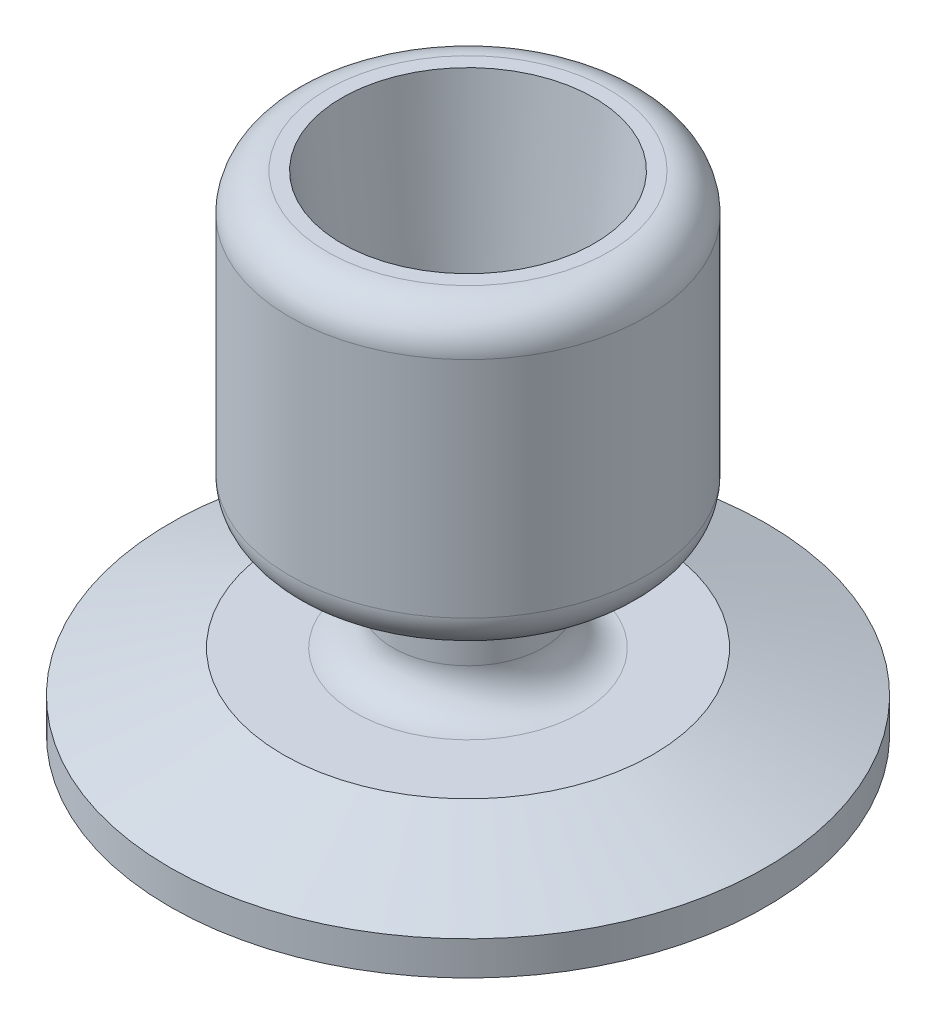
ISO-10303-21;
HEADER;
FILE_DESCRIPTION(('STEP AP214'),'2;1');
FILE_NAME('part.step','',(''),(''),'','','');
FILE_SCHEMA(('AUTOMOTIVE_DESIGN { 1 0 10303 214 1 1 1 1 }'));
ENDSEC;
DATA;
#1=APPLICATION_CONTEXT('core data for automotive mechanical design processes');
#2=APPLICATION_PROTOCOL_DEFINITION('international standard','automotive_design',2000,#1);
#3=PRODUCT_CONTEXT('',#1,'mechanical');
#4=PRODUCT('Part','Part','',(#3));
#5=PRODUCT_RELATED_PRODUCT_CATEGORY('part','',(#4));
#6=PRODUCT_DEFINITION_FORMATION('','',#4);
#7=PRODUCT_DEFINITION_CONTEXT('part definition',#1,'design');
#8=PRODUCT_DEFINITION('design','',#6,#7);
#9=PRODUCT_DEFINITION_SHAPE('','',#8);
#10=(LENGTH_UNIT() NAMED_UNIT(*) SI_UNIT(.MILLI.,.METRE.));
#11=(NAMED_UNIT(*) PLANE_ANGLE_UNIT() SI_UNIT($,.RADIAN.));
#12=(NAMED_UNIT(*) SI_UNIT($,.STERADIAN.) SOLID_ANGLE_UNIT());
#13=UNCERTAINTY_MEASURE_WITH_UNIT(LENGTH_MEASURE(1.E-05),#10,'distance_accuracy_value','');
#14=(GEOMETRIC_REPRESENTATION_CONTEXT(3) GLOBAL_UNCERTAINTY_ASSIGNED_CONTEXT((#13)) GLOBAL_UNIT_ASSIGNED_CONTEXT((#10,
#11,#12)) REPRESENTATION_CONTEXT('',''));
#15=CARTESIAN_POINT('',(0.,0.,0.));
#16=DIRECTION('',(0.,0.,1.));
#17=DIRECTION('',(1.,0.,0.));
#18=AXIS2_PLACEMENT_3D('',#15,#16,#17);
#19=CARTESIAN_POINT('',(16.6090232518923,33.7384781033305,40.9368676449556));
#20=DIRECTION('',(0.,-1.,0.));
#21=DIRECTION('',(0.,0.,-1.));
#22=AXIS2_PLACEMENT_3D('',#19,#20,#21);
#23=PLANE('',#22);
#24=CARTESIAN_POINT('',(21.3080232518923,33.7384781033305,40.9368676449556));
#25=DIRECTION('',(0.,-1.,0.));
#26=DIRECTION('',(0.,0.,-1.));
#27=AXIS2_PLACEMENT_3D('',#24,#25,#26);
#28=CIRCLE('',#27,6.35);
#29=CARTESIAN_POINT('',(21.3080232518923,33.7384781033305,34.5868676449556));
#30=VERTEX_POINT('',#29);
#31=EDGE_CURVE('P0_E10',#30,#30,#28,.T.);
#32=ORIENTED_EDGE('',*,*,#31,.F.);
#33=EDGE_LOOP('',(#32));
#34=FACE_BOUND('',#33,.T.);
#35=CARTESIAN_POINT('',(21.3080232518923,33.7384781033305,40.9368676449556));
#36=DIRECTION('',(0.,-1.,0.));
#37=DIRECTION('',(0.,0.,-1.));
#38=AXIS2_PLACEMENT_3D('',#35,#36,#37);
#39=CIRCLE('',#38,4.699);
#40=CARTESIAN_POINT('',(21.3080232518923,33.7384781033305,36.2378676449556));
#41=VERTEX_POINT('',#40);
#42=EDGE_CURVE('P0_E64',#41,#41,#39,.T.);
#43=ORIENTED_EDGE('',*,*,#42,.T.);
#44=EDGE_LOOP('',(#43));
#45=FACE_BOUND('',#44,.T.);
#46=ADVANCED_FACE('P0_F15',(#34,#45),#23,.F.);
#47=CARTESIAN_POINT('',(21.3080232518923,21.0384781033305,40.9368676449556));
#48=DIRECTION('',(0.,-1.,0.));
#49=DIRECTION('',(0.,0.,-1.));
#50=AXIS2_PLACEMENT_3D('',#47,#48,#49);
#51=CYLINDRICAL_SURFACE('',#50,6.35);
#52=CARTESIAN_POINT('',(21.3080232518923,30.5634781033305,40.9368676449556));
#53=DIRECTION('',(0.,-1.,0.));
#54=DIRECTION('',(0.,0.,-1.));
#55=AXIS2_PLACEMENT_3D('',#52,#53,#54);
#56=CIRCLE('',#55,6.35);
#57=CARTESIAN_POINT('',(21.3080232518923,30.5634781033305,34.5868676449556));
#58=VERTEX_POINT('',#57);
#59=EDGE_CURVE('P0_E21',#58,#58,#56,.T.);
#60=ORIENTED_EDGE('',*,*,#59,.F.);
#61=EDGE_LOOP('',(#60));
#62=FACE_BOUND('',#61,.T.);
#63=ORIENTED_EDGE('',*,*,#31,.T.);
#64=EDGE_LOOP('',(#63));
#65=FACE_BOUND('',#64,.T.);
#66=ADVANCED_FACE('P0_F143',(#62,#65),#51,.T.);
#67=CARTESIAN_POINT('',(21.3080232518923,30.5634781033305,40.9368676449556));
#68=DIRECTION('',(0.,-1.,0.));
#69=DIRECTION('',(0.,0.,-1.));
#70=AXIS2_PLACEMENT_3D('',#67,#68,#69);
#71=TOROIDAL_SURFACE('',#70,9.525,3.175);
#72=CARTESIAN_POINT('',(21.3080232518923,27.3884781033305,40.9368676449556));
#73=DIRECTION('',(0.,-1.,0.));
#74=DIRECTION('',(0.,0.,-1.));
#75=AXIS2_PLACEMENT_3D('',#72,#73,#74);
#76=CIRCLE('',#75,9.525);
#77=CARTESIAN_POINT('',(21.3080232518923,27.3884781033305,31.4118676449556));
#78=VERTEX_POINT('',#77);
#79=EDGE_CURVE('P0_E25',#78,#78,#76,.T.);
#80=ORIENTED_EDGE('',*,*,#79,.F.);
#81=EDGE_LOOP('',(#80));
#82=FACE_BOUND('',#81,.T.);
#83=ORIENTED_EDGE('',*,*,#59,.T.);
#84=EDGE_LOOP('',(#83));
#85=FACE_BOUND('',#84,.T.);
#86=ADVANCED_FACE('P0_F138',(#82,#85),#71,.F.);
#87=CARTESIAN_POINT('',(11.7830232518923,27.3884781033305,40.9368676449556));
#88=DIRECTION('',(0.,-1.,0.));
#89=DIRECTION('',(0.,0.,-1.));
#90=AXIS2_PLACEMENT_3D('',#87,#88,#89);
#91=PLANE('',#90);
#92=CARTESIAN_POINT('',(21.3080232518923,27.3884781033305,40.9368676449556));
#93=DIRECTION('',(0.,-1.,0.));
#94=DIRECTION('',(0.,0.,-1.));
#95=AXIS2_PLACEMENT_3D('',#92,#93,#94);
#96=CIRCLE('',#95,15.6301961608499);
#97=CARTESIAN_POINT('',(21.3080232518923,27.3884781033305,25.3066714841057));
#98=VERTEX_POINT('',#97);
#99=EDGE_CURVE('P0_E29',#98,#98,#96,.T.);
#100=ORIENTED_EDGE('',*,*,#99,.F.);
#101=EDGE_LOOP('',(#100));
#102=FACE_BOUND('',#101,.T.);
#103=ORIENTED_EDGE('',*,*,#79,.T.);
#104=EDGE_LOOP('',(#103));
#105=FACE_BOUND('',#104,.T.);
#106=ADVANCED_FACE('P0_F132',(#102,#105),#91,.F.);
#107=CARTESIAN_POINT('',(21.3080232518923,27.3884781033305,40.9368676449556));
#108=DIRECTION('',(0.,-1.,0.));
#109=DIRECTION('',(0.,0.,-1.));
#110=AXIS2_PLACEMENT_3D('',#107,#108,#109);
#111=CONICAL_SURFACE('',#110,15.6301961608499,1.22173047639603);
#112=CARTESIAN_POINT('',(21.3080232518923,23.9065190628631,40.9368676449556));
#113=DIRECTION('',(0.,-1.,0.));
#114=DIRECTION('',(0.,0.,-1.));
#115=AXIS2_PLACEMENT_3D('',#112,#113,#114);
#116=CIRCLE('',#115,25.1968);
#117=CARTESIAN_POINT('',(21.3080232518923,23.9065190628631,15.7400676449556));
#118=VERTEX_POINT('',#117);
#119=EDGE_CURVE('P0_E34',#118,#118,#116,.T.);
#120=ORIENTED_EDGE('',*,*,#119,.F.);
#121=EDGE_LOOP('',(#120));
#122=FACE_BOUND('',#121,.T.);
#123=ORIENTED_EDGE('',*,*,#99,.T.);
#124=EDGE_LOOP('',(#123));
#125=FACE_BOUND('',#124,.T.);
#126=ADVANCED_FACE('P0_F126',(#122,#125),#111,.T.);
#127=CARTESIAN_POINT('',(21.3080232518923,21.0384781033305,40.9368676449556));
#128=DIRECTION('',(0.,-1.,0.));
#129=DIRECTION('',(0.,0.,-1.));
#130=AXIS2_PLACEMENT_3D('',#127,#128,#129);
#131=CYLINDRICAL_SURFACE('',#130,25.1968);
#132=CARTESIAN_POINT('',(21.3080232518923,21.0384781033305,40.9368676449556));
#133=DIRECTION('',(0.,-1.,0.));
#134=DIRECTION('',(0.,0.,-1.));
#135=AXIS2_PLACEMENT_3D('',#132,#133,#134);
#136=CIRCLE('',#135,25.1968);
#137=CARTESIAN_POINT('',(21.3080232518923,21.0384781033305,15.7400676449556));
#138=VERTEX_POINT('',#137);
#139=EDGE_CURVE('P0_E37',#138,#138,#136,.T.);
#140=ORIENTED_EDGE('',*,*,#139,.F.);
#141=EDGE_LOOP('',(#140));
#142=FACE_BOUND('',#141,.T.);
#143=ORIENTED_EDGE('',*,*,#119,.T.);
#144=EDGE_LOOP('',(#143));
#145=FACE_BOUND('',#144,.T.);
#146=ADVANCED_FACE('P0_F120',(#142,#145),#131,.T.);
#147=CARTESIAN_POINT('',(-3.88877674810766,21.0384781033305,40.9368676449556));
#148=DIRECTION('',(0.,1.,0.));
#149=DIRECTION('',(0.,0.,1.));
#150=AXIS2_PLACEMENT_3D('',#147,#148,#149);
#151=PLANE('',#150);
#152=CARTESIAN_POINT('',(21.3080232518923,21.0384781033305,40.9368676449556));
#153=DIRECTION('',(0.,-1.,0.));
#154=DIRECTION('',(0.,0.,-1.));
#155=AXIS2_PLACEMENT_3D('',#152,#153,#154);
#156=CIRCLE('',#155,23.8091722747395);
#157=CARTESIAN_POINT('',(21.3080232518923,21.0384781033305,17.127695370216));
#158=VERTEX_POINT('',#157);
#159=EDGE_CURVE('P0_E40',#158,#158,#156,.T.);
#160=ORIENTED_EDGE('',*,*,#159,.F.);
#161=EDGE_LOOP('',(#160));
#162=FACE_BOUND('',#161,.T.);
#163=ORIENTED_EDGE('',*,*,#139,.T.);
#164=EDGE_LOOP('',(#163));
#165=FACE_BOUND('',#164,.T.);
#166=ADVANCED_FACE('P0_F114',(#162,#165),#151,.F.);
#167=CARTESIAN_POINT('',(21.3080232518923,21.8258781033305,40.9368676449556));
#168=DIRECTION('',(0.,-1.,0.));
#169=DIRECTION('',(0.,0.,-1.));
#170=AXIS2_PLACEMENT_3D('',#167,#168,#169);
#171=TOROIDAL_SURFACE('',#170,23.8091722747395,0.787399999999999);
#172=CARTESIAN_POINT('',(21.3080232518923,21.5182164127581,40.9368676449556));
#173=DIRECTION('',(0.,-1.,0.));
#174=DIRECTION('',(0.,0.,-1.));
#175=AXIS2_PLACEMENT_3D('',#172,#173,#174);
#176=CIRCLE('',#175,23.0843667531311);
#177=CARTESIAN_POINT('',(21.3080232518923,21.5182164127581,17.8525008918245));
#178=VERTEX_POINT('',#177);
#179=EDGE_CURVE('P0_E43',#178,#178,#176,.T.);
#180=ORIENTED_EDGE('',*,*,#179,.F.);
#181=EDGE_LOOP('',(#180));
#182=FACE_BOUND('',#181,.T.);
#183=ORIENTED_EDGE('',*,*,#159,.T.);
#184=EDGE_LOOP('',(#183));
#185=FACE_BOUND('',#184,.T.);
#186=ADVANCED_FACE('P0_F108',(#182,#185),#171,.T.);
#187=CARTESIAN_POINT('',(21.3080232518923,21.5182164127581,40.9368676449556));
#188=DIRECTION('',(0.,-1.,0.));
#189=DIRECTION('',(0.,0.,-1.));
#190=AXIS2_PLACEMENT_3D('',#187,#188,#189);
#191=CONICAL_SURFACE('',#190,23.0843667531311,0.401425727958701);
#192=CARTESIAN_POINT('',(21.3080232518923,21.911332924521,40.9368676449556));
#193=DIRECTION('',(0.,-1.,0.));
#194=DIRECTION('',(0.,0.,-1.));
#195=AXIS2_PLACEMENT_3D('',#192,#193,#194);
#196=CIRCLE('',#195,22.9174986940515);
#197=CARTESIAN_POINT('',(21.3080232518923,21.911332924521,18.019368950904));
#198=VERTEX_POINT('',#197);
#199=EDGE_CURVE('P0_E46',#198,#198,#196,.T.);
#200=ORIENTED_EDGE('',*,*,#199,.F.);
#201=EDGE_LOOP('',(#200));
#202=FACE_BOUND('',#201,.T.);
#203=ORIENTED_EDGE('',*,*,#179,.T.);
#204=EDGE_LOOP('',(#203));
#205=FACE_BOUND('',#204,.T.);
#206=ADVANCED_FACE('P0_F102',(#202,#205),#191,.F.);
#207=CARTESIAN_POINT('',(21.3080232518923,21.4448781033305,40.9368676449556));
#208=DIRECTION('',(0.,-1.,0.));
#209=DIRECTION('',(0.,0.,-1.));
#210=AXIS2_PLACEMENT_3D('',#207,#208,#209);
#211=TOROIDAL_SURFACE('',#210,21.8186,1.1938);
#212=CARTESIAN_POINT('',(21.3080232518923,21.911332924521,40.9368676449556));
#213=DIRECTION('',(0.,-1.,0.));
#214=DIRECTION('',(0.,0.,-1.));
#215=AXIS2_PLACEMENT_3D('',#212,#213,#214);
#216=CIRCLE('',#215,20.7197013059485);
#217=CARTESIAN_POINT('',(21.3080232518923,21.911332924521,20.2171663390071));
#218=VERTEX_POINT('',#217);
#219=EDGE_CURVE('P0_E49',#218,#218,#216,.T.);
#220=ORIENTED_EDGE('',*,*,#219,.F.);
#221=EDGE_LOOP('',(#220));
#222=FACE_BOUND('',#221,.T.);
#223=ORIENTED_EDGE('',*,*,#199,.T.);
#224=EDGE_LOOP('',(#223));
#225=FACE_BOUND('',#224,.T.);
#226=ADVANCED_FACE('P0_F96',(#222,#225),#211,.F.);
#227=CARTESIAN_POINT('',(21.3080232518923,21.911332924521,40.9368676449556));
#228=DIRECTION('',(0.,1.,0.));
#229=DIRECTION('',(0.,0.,1.));
#230=AXIS2_PLACEMENT_3D('',#227,#228,#229);
#231=CONICAL_SURFACE('',#230,20.7197013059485,0.401425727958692);
#232=CARTESIAN_POINT('',(21.3080232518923,21.5182164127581,40.9368676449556));
#233=DIRECTION('',(0.,-1.,0.));
#234=DIRECTION('',(0.,0.,-1.));
#235=AXIS2_PLACEMENT_3D('',#232,#233,#234);
#236=CIRCLE('',#235,20.5528332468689);
#237=CARTESIAN_POINT('',(21.3080232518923,21.5182164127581,20.3840343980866));
#238=VERTEX_POINT('',#237);
#239=EDGE_CURVE('P0_E52',#238,#238,#236,.T.);
#240=ORIENTED_EDGE('',*,*,#239,.F.);
#241=EDGE_LOOP('',(#240));
#242=FACE_BOUND('',#241,.T.);
#243=ORIENTED_EDGE('',*,*,#219,.T.);
#244=EDGE_LOOP('',(#243));
#245=FACE_BOUND('',#244,.T.);
#246=ADVANCED_FACE('P0_F90',(#242,#245),#231,.T.);
#247=CARTESIAN_POINT('',(21.3080232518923,21.8258781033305,40.9368676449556));
#248=DIRECTION('',(0.,-1.,0.));
#249=DIRECTION('',(0.,0.,-1.));
#250=AXIS2_PLACEMENT_3D('',#247,#248,#249);
#251=TOROIDAL_SURFACE('',#250,19.8280277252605,0.787399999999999);
#252=CARTESIAN_POINT('',(21.3080232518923,21.0384781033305,40.9368676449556));
#253=DIRECTION('',(0.,-1.,0.));
#254=DIRECTION('',(0.,0.,-1.));
#255=AXIS2_PLACEMENT_3D('',#252,#253,#254);
#256=CIRCLE('',#255,19.8280277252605);
#257=CARTESIAN_POINT('',(21.3080232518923,21.0384781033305,21.1088399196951));
#258=VERTEX_POINT('',#257);
#259=EDGE_CURVE('P0_E55',#258,#258,#256,.T.);
#260=ORIENTED_EDGE('',*,*,#259,.F.);
#261=EDGE_LOOP('',(#260));
#262=FACE_BOUND('',#261,.T.);
#263=ORIENTED_EDGE('',*,*,#239,.T.);
#264=EDGE_LOOP('',(#263));
#265=FACE_BOUND('',#264,.T.);
#266=ADVANCED_FACE('P0_F84',(#262,#265),#251,.T.);
#267=CARTESIAN_POINT('',(1.47999552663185,21.0384781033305,40.9368676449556));
#268=DIRECTION('',(0.,1.,0.));
#269=DIRECTION('',(0.,0.,1.));
#270=AXIS2_PLACEMENT_3D('',#267,#268,#269);
#271=PLANE('',#270);
#272=CARTESIAN_POINT('',(21.3080232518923,21.0384781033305,40.9368676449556));
#273=DIRECTION('',(0.,-1.,0.));
#274=DIRECTION('',(0.,0.,-1.));
#275=AXIS2_PLACEMENT_3D('',#272,#273,#274);
#276=CIRCLE('',#275,11.049);
#277=CARTESIAN_POINT('',(21.3080232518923,21.0384781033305,29.8878676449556));
#278=VERTEX_POINT('',#277);
#279=EDGE_CURVE('P0_E58',#278,#278,#276,.T.);
#280=ORIENTED_EDGE('',*,*,#279,.F.);
#281=EDGE_LOOP('',(#280));
#282=FACE_BOUND('',#281,.T.);
#283=ORIENTED_EDGE('',*,*,#259,.T.);
#284=EDGE_LOOP('',(#283));
#285=FACE_BOUND('',#284,.T.);
#286=ADVANCED_FACE('P0_F78',(#282,#285),#271,.F.);
#287=CARTESIAN_POINT('',(21.3080232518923,21.0384781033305,40.9368676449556));
#288=DIRECTION('',(0.,-1.,0.));
#289=DIRECTION('',(0.,0.,-1.));
#290=AXIS2_PLACEMENT_3D('',#287,#288,#289);
#291=CONICAL_SURFACE('',#290,11.049,0.65606926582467);
#292=CARTESIAN_POINT('',(21.3080232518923,29.2870988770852,40.9368676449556));
#293=DIRECTION('',(0.,-1.,0.));
#294=DIRECTION('',(0.,0.,-1.));
#295=AXIS2_PLACEMENT_3D('',#292,#293,#294);
#296=CIRCLE('',#295,4.699);
#297=CARTESIAN_POINT('',(21.3080232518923,29.2870988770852,36.2378676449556));
#298=VERTEX_POINT('',#297);
#299=EDGE_CURVE('P0_E61',#298,#298,#296,.T.);
#300=ORIENTED_EDGE('',*,*,#299,.F.);
#301=EDGE_LOOP('',(#300));
#302=FACE_BOUND('',#301,.T.);
#303=ORIENTED_EDGE('',*,*,#279,.T.);
#304=EDGE_LOOP('',(#303));
#305=FACE_BOUND('',#304,.T.);
#306=ADVANCED_FACE('P0_F72',(#302,#305),#291,.F.);
#307=CARTESIAN_POINT('',(21.3080232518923,21.0384781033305,40.9368676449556));
#308=DIRECTION('',(0.,-1.,0.));
#309=DIRECTION('',(0.,0.,-1.));
#310=AXIS2_PLACEMENT_3D('',#307,#308,#309);
#311=CYLINDRICAL_SURFACE('',#310,4.699);
#312=ORIENTED_EDGE('',*,*,#42,.F.);
#313=EDGE_LOOP('',(#312));
#314=FACE_BOUND('',#313,.T.);
#315=ORIENTED_EDGE('',*,*,#299,.T.);
#316=EDGE_LOOP('',(#315));
#317=FACE_BOUND('',#316,.T.);
#318=ADVANCED_FACE('P0_F69',(#314,#317),#311,.F.);
#319=CLOSED_SHELL('',(#46,#66,#86,#106,#126,#146,#166,#186,#206,#226,#246,#266,#286,#306,#318));
#320=MANIFOLD_SOLID_BREP('P0_B1',#319);
#321=CARTESIAN_POINT('',(21.3080232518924,33.7384781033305,40.9368676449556));
#322=DIRECTION('',(0.,-1.,0.));
#323=DIRECTION('',(-0.915085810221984,0.,0.403259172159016));
#324=AXIS2_PLACEMENT_3D('',#321,#322,#323);
#325=CYLINDRICAL_SURFACE('',#324,4.699);
#326=CARTESIAN_POINT('',(21.3080232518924,41.6063205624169,40.9368676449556));
#327=DIRECTION('',(0.,-1.,0.));
#328=DIRECTION('',(-0.915085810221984,0.,0.403259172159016));
#329=AXIS2_PLACEMENT_3D('',#326,#327,#328);
#330=CIRCLE('',#329,4.699);
#331=CARTESIAN_POINT('',(17.0080350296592,41.6063205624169,42.8317824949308));
#332=VERTEX_POINT('',#331);
#333=EDGE_CURVE('P1_E57',#332,#332,#330,.T.);
#334=ORIENTED_EDGE('',*,*,#333,.F.);
#335=EDGE_LOOP('',(#334));
#336=FACE_BOUND('',#335,.T.);
#337=CARTESIAN_POINT('',(21.3080232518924,33.7384781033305,40.9368676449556));
#338=DIRECTION('',(0.,-1.,0.));
#339=DIRECTION('',(-0.915085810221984,0.,0.403259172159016));
#340=AXIS2_PLACEMENT_3D('',#337,#338,#339);
#341=CIRCLE('',#340,4.699);
#342=CARTESIAN_POINT('',(17.0080350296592,33.7384781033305,42.8317824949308));
#343=VERTEX_POINT('',#342);
#344=EDGE_CURVE('P1_E9',#343,#343,#341,.T.);
#345=ORIENTED_EDGE('',*,*,#344,.T.);
#346=EDGE_LOOP('',(#345));
#347=FACE_BOUND('',#346,.T.);
#348=ADVANCED_FACE('P1_F14',(#336,#347),#325,.F.);
#349=CARTESIAN_POINT('',(19.4131084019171,33.7384781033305,36.6368794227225));
#350=DIRECTION('',(0.,1.,0.));
#351=DIRECTION('',(0.915085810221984,0.,-0.403259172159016));
#352=AXIS2_PLACEMENT_3D('',#349,#350,#351);
#353=PLANE('',#352);
#354=ORIENTED_EDGE('',*,*,#344,.F.);
#355=EDGE_LOOP('',(#354));
#356=FACE_BOUND('',#355,.T.);
#357=CARTESIAN_POINT('',(21.3080232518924,33.7384781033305,40.9368676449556));
#358=DIRECTION('',(0.,-1.,0.));
#359=DIRECTION('',(-0.915085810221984,0.,0.403259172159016));
#360=AXIS2_PLACEMENT_3D('',#357,#358,#359);
#361=CIRCLE('',#360,6.35);
#362=CARTESIAN_POINT('',(15.4972283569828,33.7384781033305,43.4975633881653));
#363=VERTEX_POINT('',#362);
#364=EDGE_CURVE('P1_E20',#363,#363,#361,.T.);
#365=ORIENTED_EDGE('',*,*,#364,.T.);
#366=EDGE_LOOP('',(#365));
#367=FACE_BOUND('',#366,.T.);
#368=ADVANCED_FACE('P1_F64',(#356,#367),#353,.F.);
#369=CARTESIAN_POINT('',(21.3080232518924,33.7384781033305,40.9368676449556));
#370=DIRECTION('',(0.,-1.,0.));
#371=DIRECTION('',(-0.915085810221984,0.,0.403259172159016));
#372=AXIS2_PLACEMENT_3D('',#369,#370,#371);
#373=CYLINDRICAL_SURFACE('',#372,6.35);
#374=ORIENTED_EDGE('',*,*,#364,.F.);
#375=EDGE_LOOP('',(#374));
#376=FACE_BOUND('',#375,.T.);
#377=CARTESIAN_POINT('',(21.3080232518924,35.4641661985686,40.9368676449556));
#378=DIRECTION('',(0.,-1.,0.));
#379=DIRECTION('',(-0.915085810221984,0.,0.403259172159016));
#380=AXIS2_PLACEMENT_3D('',#377,#378,#379);
#381=CIRCLE('',#380,6.35);
#382=CARTESIAN_POINT('',(15.4972283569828,35.4641661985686,43.4975633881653));
#383=VERTEX_POINT('',#382);
#384=EDGE_CURVE('P1_E24',#383,#383,#381,.T.);
#385=ORIENTED_EDGE('',*,*,#384,.T.);
#386=EDGE_LOOP('',(#385));
#387=FACE_BOUND('',#386,.T.);
#388=ADVANCED_FACE('P1_F69',(#376,#387),#373,.T.);
#389=CARTESIAN_POINT('',(21.3080232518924,35.4641661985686,40.9368676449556));
#390=DIRECTION('',(0.,-1.,0.));
#391=DIRECTION('',(-0.915085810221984,0.,0.403259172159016));
#392=AXIS2_PLACEMENT_3D('',#389,#390,#391);
#393=TOROIDAL_SURFACE('',#392,7.9248,1.5748);
#394=ORIENTED_EDGE('',*,*,#384,.F.);
#395=EDGE_LOOP('',(#394));
#396=FACE_BOUND('',#395,.T.);
#397=CARTESIAN_POINT('',(21.3080232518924,37.0389661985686,40.9368676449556));
#398=DIRECTION('',(0.,-1.,0.));
#399=DIRECTION('',(-0.915085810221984,0.,0.403259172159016));
#400=AXIS2_PLACEMENT_3D('',#397,#398,#399);
#401=CIRCLE('',#400,7.92480000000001);
#402=CARTESIAN_POINT('',(14.0561512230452,37.0389661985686,44.1326159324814));
#403=VERTEX_POINT('',#402);
#404=EDGE_CURVE('P1_E28',#403,#403,#401,.T.);
#405=ORIENTED_EDGE('',*,*,#404,.T.);
#406=EDGE_LOOP('',(#405));
#407=FACE_BOUND('',#406,.T.);
#408=ADVANCED_FACE('P1_F74',(#396,#407),#393,.F.);
#409=CARTESIAN_POINT('',(18.1122749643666,37.0389661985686,33.6849956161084));
#410=DIRECTION('',(0.,1.,0.));
#411=DIRECTION('',(0.915085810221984,0.,-0.403259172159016));
#412=AXIS2_PLACEMENT_3D('',#409,#410,#411);
#413=PLANE('',#412);
#414=ORIENTED_EDGE('',*,*,#404,.F.);
#415=EDGE_LOOP('',(#414));
#416=FACE_BOUND('',#415,.T.);
#417=CARTESIAN_POINT('',(21.3080232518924,37.0389661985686,40.9368676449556));
#418=DIRECTION('',(0.,-1.,0.));
#419=DIRECTION('',(-0.915085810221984,0.,0.403259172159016));
#420=AXIS2_PLACEMENT_3D('',#417,#418,#419);
#421=CIRCLE('',#420,11.8999);
#422=CARTESIAN_POINT('',(10.4185936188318,37.0389661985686,45.7356114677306));
#423=VERTEX_POINT('',#422);
#424=EDGE_CURVE('P1_E33',#423,#423,#421,.T.);
#425=ORIENTED_EDGE('',*,*,#424,.T.);
#426=EDGE_LOOP('',(#425));
#427=FACE_BOUND('',#426,.T.);
#428=ADVANCED_FACE('P1_F80',(#416,#427),#413,.F.);
#429=CARTESIAN_POINT('',(21.3080232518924,40.2139661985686,40.9368676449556));
#430=DIRECTION('',(0.,-1.,0.));
#431=DIRECTION('',(-0.915085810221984,0.,0.403259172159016));
#432=AXIS2_PLACEMENT_3D('',#429,#430,#431);
#433=TOROIDAL_SURFACE('',#432,11.8999,3.175);
#434=ORIENTED_EDGE('',*,*,#424,.F.);
#435=EDGE_LOOP('',(#434));
#436=FACE_BOUND('',#435,.T.);
#437=CARTESIAN_POINT('',(21.3080232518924,40.2139661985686,40.9368676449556));
#438=DIRECTION('',(0.,-1.,0.));
#439=DIRECTION('',(-0.915085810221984,0.,0.403259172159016));
#440=AXIS2_PLACEMENT_3D('',#437,#438,#439);
#441=CIRCLE('',#440,15.0749);
#442=CARTESIAN_POINT('',(7.51319617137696,40.2139661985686,47.0159593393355));
#443=VERTEX_POINT('',#442);
#444=EDGE_CURVE('P1_E36',#443,#443,#441,.T.);
#445=ORIENTED_EDGE('',*,*,#444,.T.);
#446=EDGE_LOOP('',(#445));
#447=FACE_BOUND('',#446,.T.);
#448=ADVANCED_FACE('P1_F84',(#436,#447),#433,.T.);
#449=CARTESIAN_POINT('',(21.3080232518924,33.7384781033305,40.9368676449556));
#450=DIRECTION('',(0.,-1.,0.));
#451=DIRECTION('',(-0.915085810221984,0.,0.403259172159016));
#452=AXIS2_PLACEMENT_3D('',#449,#450,#451);
#453=CYLINDRICAL_SURFACE('',#452,15.0749);
#454=ORIENTED_EDGE('',*,*,#444,.F.);
#455=EDGE_LOOP('',(#454));
#456=FACE_BOUND('',#455,.T.);
#457=CARTESIAN_POINT('',(21.3080232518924,59.1384781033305,40.9368676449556));
#458=DIRECTION('',(0.,-1.,0.));
#459=DIRECTION('',(-0.915085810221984,0.,0.403259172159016));
#460=AXIS2_PLACEMENT_3D('',#457,#458,#459);
#461=CIRCLE('',#460,15.0749);
#462=CARTESIAN_POINT('',(7.51319617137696,59.1384781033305,47.0159593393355));
#463=VERTEX_POINT('',#462);
#464=EDGE_CURVE('P1_E39',#463,#463,#461,.T.);
#465=ORIENTED_EDGE('',*,*,#464,.T.);
#466=EDGE_LOOP('',(#465));
#467=FACE_BOUND('',#466,.T.);
#468=ADVANCED_FACE('P1_F88',(#456,#467),#453,.T.);
#469=CARTESIAN_POINT('',(21.3080232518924,59.1384781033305,40.9368676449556));
#470=DIRECTION('',(0.,-1.,0.));
#471=DIRECTION('',(-0.915085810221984,0.,0.403259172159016));
#472=AXIS2_PLACEMENT_3D('',#469,#470,#471);
#473=TOROIDAL_SURFACE('',#472,11.8999,3.175);
#474=ORIENTED_EDGE('',*,*,#464,.F.);
#475=EDGE_LOOP('',(#474));
#476=FACE_BOUND('',#475,.T.);
#477=CARTESIAN_POINT('',(21.3080232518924,62.3134781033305,40.9368676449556));
#478=DIRECTION('',(0.,-1.,0.));
#479=DIRECTION('',(-0.915085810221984,0.,0.403259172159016));
#480=AXIS2_PLACEMENT_3D('',#477,#478,#479);
#481=CIRCLE('',#480,11.8999);
#482=CARTESIAN_POINT('',(10.4185936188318,62.3134781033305,45.7356114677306));
#483=VERTEX_POINT('',#482);
#484=EDGE_CURVE('P1_E42',#483,#483,#481,.T.);
#485=ORIENTED_EDGE('',*,*,#484,.T.);
#486=EDGE_LOOP('',(#485));
#487=FACE_BOUND('',#486,.T.);
#488=ADVANCED_FACE('P1_F92',(#476,#487),#473,.T.);
#489=CARTESIAN_POINT('',(16.5092794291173,62.3134781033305,30.047438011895));
#490=DIRECTION('',(0.,-1.,0.));
#491=DIRECTION('',(-0.915085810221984,0.,0.403259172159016));
#492=AXIS2_PLACEMENT_3D('',#489,#490,#491);
#493=PLANE('',#492);
#494=ORIENTED_EDGE('',*,*,#484,.F.);
#495=EDGE_LOOP('',(#494));
#496=FACE_BOUND('',#495,.T.);
#497=CARTESIAN_POINT('',(21.3080232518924,62.3134781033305,40.9368676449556));
#498=DIRECTION('',(0.,-1.,0.));
#499=DIRECTION('',(-0.915085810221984,0.,0.403259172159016));
#500=AXIS2_PLACEMENT_3D('',#497,#498,#499);
#501=CIRCLE('',#500,10.668);
#502=CARTESIAN_POINT('',(11.5458878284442,62.3134781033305,45.238836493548));
#503=VERTEX_POINT('',#502);
#504=EDGE_CURVE('P1_E45',#503,#503,#501,.T.);
#505=ORIENTED_EDGE('',*,*,#504,.T.);
#506=EDGE_LOOP('',(#505));
#507=FACE_BOUND('',#506,.T.);
#508=ADVANCED_FACE('P1_F96',(#496,#507),#493,.F.);
#509=CARTESIAN_POINT('',(21.3080232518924,48.0259781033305,40.9368676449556));
#510=DIRECTION('',(0.,1.,0.));
#511=DIRECTION('',(0.915085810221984,0.,-0.403259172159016));
#512=AXIS2_PLACEMENT_3D('',#509,#510,#511);
#513=CONICAL_SURFACE('',#512,9.2202,0.100988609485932);
#514=ORIENTED_EDGE('',*,*,#504,.F.);
#515=EDGE_LOOP('',(#514));
#516=FACE_BOUND('',#515,.T.);
#517=CARTESIAN_POINT('',(21.3080232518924,48.0259781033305,40.9368676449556));
#518=DIRECTION('',(0.,-1.,0.));
#519=DIRECTION('',(-0.915085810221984,0.,0.403259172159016));
#520=AXIS2_PLACEMENT_3D('',#517,#518,#519);
#521=CIRCLE('',#520,9.2202);
#522=CARTESIAN_POINT('',(12.8707490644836,48.0259781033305,44.6549978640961));
#523=VERTEX_POINT('',#522);
#524=EDGE_CURVE('P1_E48',#523,#523,#521,.T.);
#525=ORIENTED_EDGE('',*,*,#524,.T.);
#526=EDGE_LOOP('',(#525));
#527=FACE_BOUND('',#526,.T.);
#528=ADVANCED_FACE('P1_F100',(#516,#527),#513,.F.);
#529=CARTESIAN_POINT('',(17.5898930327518,48.0259781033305,32.4995934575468));
#530=DIRECTION('',(0.,-1.,0.));
#531=DIRECTION('',(-0.915085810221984,0.,0.403259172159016));
#532=AXIS2_PLACEMENT_3D('',#529,#530,#531);
#533=PLANE('',#532);
#534=ORIENTED_EDGE('',*,*,#524,.F.);
#535=EDGE_LOOP('',(#534));
#536=FACE_BOUND('',#535,.T.);
#537=CARTESIAN_POINT('',(21.3080232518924,48.0259781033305,40.9368676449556));
#538=DIRECTION('',(0.,-1.,0.));
#539=DIRECTION('',(-0.915085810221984,0.,0.403259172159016));
#540=AXIS2_PLACEMENT_3D('',#537,#538,#539);
#541=CIRCLE('',#540,8.5725);
#542=CARTESIAN_POINT('',(13.4634501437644,48.0259781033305,44.3938068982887));
#543=VERTEX_POINT('',#542);
#544=EDGE_CURVE('P1_E51',#543,#543,#541,.T.);
#545=ORIENTED_EDGE('',*,*,#544,.T.);
#546=EDGE_LOOP('',(#545));
#547=FACE_BOUND('',#546,.T.);
#548=ADVANCED_FACE('P1_F104',(#536,#547),#533,.F.);
#549=CARTESIAN_POINT('',(21.3080232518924,33.7384781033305,40.9368676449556));
#550=DIRECTION('',(0.,-1.,0.));
#551=DIRECTION('',(-0.915085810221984,0.,0.403259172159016));
#552=AXIS2_PLACEMENT_3D('',#549,#550,#551);
#553=CYLINDRICAL_SURFACE('',#552,8.5725);
#554=ORIENTED_EDGE('',*,*,#544,.F.);
#555=EDGE_LOOP('',(#554));
#556=FACE_BOUND('',#555,.T.);
#557=CARTESIAN_POINT('',(21.3080232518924,46.2225781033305,40.9368676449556));
#558=DIRECTION('',(0.,-1.,0.));
#559=DIRECTION('',(-0.915085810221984,0.,0.403259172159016));
#560=AXIS2_PLACEMENT_3D('',#557,#558,#559);
#561=CIRCLE('',#560,8.5725);
#562=CARTESIAN_POINT('',(13.4634501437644,46.2225781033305,44.3938068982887));
#563=VERTEX_POINT('',#562);
#564=EDGE_CURVE('P1_E54',#563,#563,#561,.T.);
#565=ORIENTED_EDGE('',*,*,#564,.T.);
#566=EDGE_LOOP('',(#565));
#567=FACE_BOUND('',#566,.T.);
#568=ADVANCED_FACE('P1_F108',(#556,#567),#553,.F.);
#569=CARTESIAN_POINT('',(21.3080232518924,41.6063205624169,40.9368676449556));
#570=DIRECTION('',(0.,1.,0.));
#571=DIRECTION('',(0.915085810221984,0.,-0.403259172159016));
#572=AXIS2_PLACEMENT_3D('',#569,#570,#571);
#573=CONICAL_SURFACE('',#572,4.699,0.698131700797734);
#574=ORIENTED_EDGE('',*,*,#564,.F.);
#575=EDGE_LOOP('',(#574));
#576=FACE_BOUND('',#575,.T.);
#577=ORIENTED_EDGE('',*,*,#333,.T.);
#578=EDGE_LOOP('',(#577));
#579=FACE_BOUND('',#578,.T.);
#580=ADVANCED_FACE('P1_F61',(#576,#579),#573,.F.);
#581=CLOSED_SHELL('',(#348,#368,#388,#408,#428,#448,#468,#488,#508,#528,#548,#568,#580));
#582=MANIFOLD_SOLID_BREP('P1_B1',#581);
#583=ADVANCED_BREP_SHAPE_REPRESENTATION('',(#18,#320,#582),#14);
#584=SHAPE_DEFINITION_REPRESENTATION(#9,#583);
ENDSEC;
END-ISO-10303-21;
